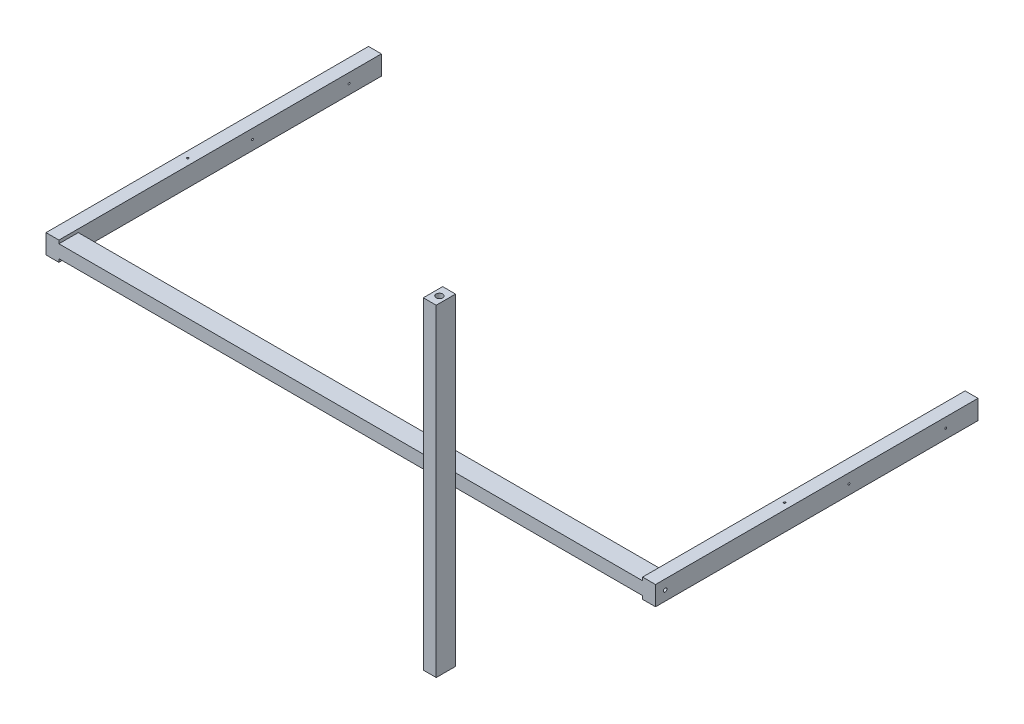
from build123d import *

# Parameters (mm, degrees)
ESQUISSE1_W                  = 40
ESQUISSE1_H                  = 60
BOSS_EXTRU_1_DEPTH           = 1000
BOSS_EXTRU_1_2_DEPTH         = 1000
ESQUISSE2_W                  = 40
ESQUISSE2_H                  = 60
BOSS_EXTRU_2_DEPTH           = 500
ESQUISSE3_W                  = 60
ESQUISSE3_H                  = 40
BOSS_EXTRU_3_DEPTH           = 905
ENL_V_MAT_EXTRU_1_DEPTH      = 1737.843401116
ENL_V_MAT_EXTRU_1_DEPTH_BACK = 1737.843401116
ESQUISSE4_R                  = 10.343445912
ESQUISSE4_R_2                = 3
ESQUISSE5_R                  = 3
ESQUISSE5_R_2                = 5.5
ENL_V_MAT_EXTRU_2_DEPTH      = 2224.892983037


with BuildPart() as part:
    # Esquisse1 → Boss.-Extru.1 (new body)
    with BuildSketch(Plane.XY):
        with Locations((-925, 0)):
            Rectangle(ESQUISSE1_W, ESQUISSE1_H)
    extrude(amount=BOSS_EXTRU_1_DEPTH)



with BuildPart() as body_2:
    # Esquisse1 → Boss.-Extru.1 2 (new body)
    with BuildSketch(Plane.XY):
        with Locations((925, 0)):
            Rectangle(ESQUISSE1_W, ESQUISSE1_H)
    extrude(amount=BOSS_EXTRU_1_2_DEPTH)


with BuildPart() as body_3:
    # Esquisse2 → Boss.-Extru.2 (new, symmetric)
    with BuildSketch(Plane(origin=(0, 0, 0), x_dir=(1, 0, 0), z_dir=(0, 1, 0))):
        with Locations((305, -1030)):
            Rectangle(ESQUISSE2_W, ESQUISSE2_H)
    extrude(amount=BOSS_EXTRU_2_DEPTH, both=True)


with BuildPart() as part_1:
    add(part.part)

    add(body_2.part)  # Boss.-Extru.3 merges body 2
    # Esquisse3 → Boss.-Extru.3 (add, symmetric)
    with BuildSketch(Plane(origin=(0, 0, 0), x_dir=(0, 0, -1), z_dir=(1, 0, 0))):
        with Locations((-970, 0)):
            Rectangle(ESQUISSE3_W, ESQUISSE3_H)
    extrude(amount=BOSS_EXTRU_3_DEPTH, both=True)


with BuildPart() as enl_v_mat_extru_1_tool:
    # Esquisse4 → Enl_v. mat.-Extru.1 (new, two sides: drawn at the far end of the back side and taken through both)
    with BuildSketch(Plane.XZ.offset(500).offset(-ENL_V_MAT_EXTRU_1_DEPTH_BACK)):
        with Locations(Location((305, 1030, 0), (0, 0, 270))):
            Circle(ESQUISSE4_R)
        with Locations((925, 580)):
            Circle(ESQUISSE4_R_2)
        with Locations((-925, 580)):
            Circle(ESQUISSE4_R_2)
    extrude(amount=ENL_V_MAT_EXTRU_1_DEPTH + ENL_V_MAT_EXTRU_1_DEPTH_BACK)


with BuildPart() as part_2:
    add(part_1.part)

    # Enl_v. mat.-Extru.1: cut by enl_v_mat_extru_1_tool
    add(enl_v_mat_extru_1_tool.part, mode=Mode.SUBTRACT)

    # Esquisse5 → Enl_v. mat.-Extru.2 (cut, through all)
    with BuildSketch(Plane.ZY.offset(945)):
        with Locations((100, 0)):
            Circle(ESQUISSE5_R)
        with Locations((400, 0)):
            Circle(ESQUISSE5_R)
        with Locations((970, 0)):
            Circle(ESQUISSE5_R_2)
        with Locations((970, 93.75)):
            Circle(ESQUISSE5_R_2)
        with Locations((970, -93.75)):
            Circle(ESQUISSE5_R_2)
    extrude(amount=-ENL_V_MAT_EXTRU_2_DEPTH, mode=Mode.SUBTRACT)


with BuildPart() as body_3_1:
    add(body_3.part)

    # Enl_v. mat.-Extru.1: cut by enl_v_mat_extru_1_tool
    add(enl_v_mat_extru_1_tool.part, mode=Mode.SUBTRACT)


solid = Compound([part_2.part, body_3_1.part])
